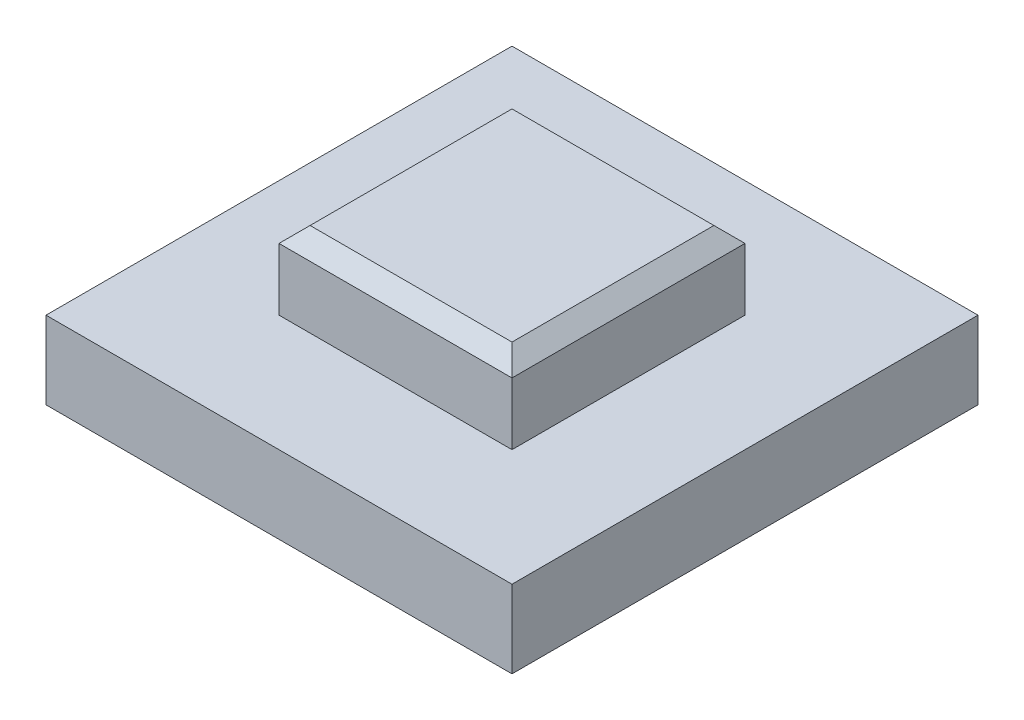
from build123d import *

# Parameters (mm, degrees)
SKETCH1_W      = 76.2
SKETCH1_H      = 76.2
EXTRUDE1_DEPTH = 12.7
SKETCH2_W      = 38.1
SKETCH2_H      = 38.1
EXTRUDE2_DEPTH = 12.7
CHAMFER1_SIZE  = 2.54


with BuildPart() as part:
    # Sketch1 → Extrude1 (new body)
    with BuildSketch(Plane(origin=(0, 0, 0), x_dir=(1, 0, 0), z_dir=(0, 1, 0))):
        Rectangle(SKETCH1_W, SKETCH1_H)
    extrude(amount=EXTRUDE1_DEPTH)

    # Sketch2 → Extrude2 (add)
    with BuildSketch(Plane(origin=(0, 12.7, 0), x_dir=(-1, 0, 0), z_dir=(0, 1, 0))):
        Rectangle(SKETCH2_W, SKETCH2_H)
    extrude(amount=EXTRUDE2_DEPTH)

    # Chamfer1
    chamfer1_edges = [part.edges().sort_by_distance(p)[0] for p in [
        (19.05, 25.4, 0),
        (0, 25.4, -19.05),
        (-19.05, 25.4, 0),
        (0, 25.4, 19.05),
    ]]
    chamfer(chamfer1_edges, length=CHAMFER1_SIZE)


solid = part.part
